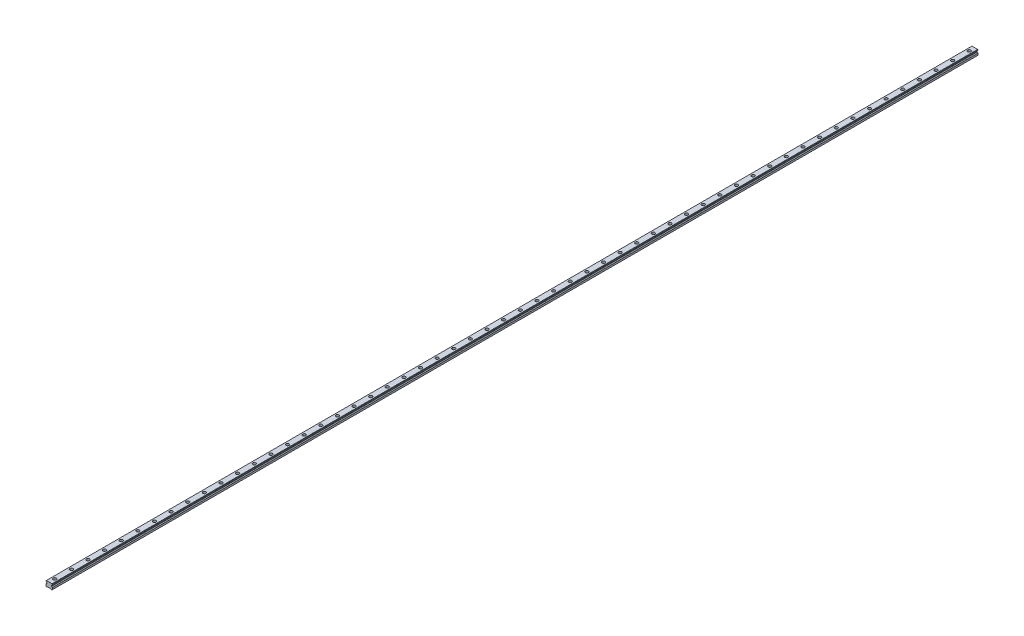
from build123d import *

# Parameters (mm, degrees)
SKETCH1_W           = 23
SKETCH1_H           = 19.2
BOSS_EXTRUDE1_DEPTH = 1670
CUT_EXTRUDE1_DEPTH  = 3341.074982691
CHAMFER1_SIZE       = 1.25
FILLET1_R           = 1.25
CUT_EXTRUDE2_DEPTH  = 3341.074982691
SKETCH4_R           = 5.5
SKETCH4_R_2         = 3.5
CUT_EXTRUDE3_DEPTH  = 9
SKETCH4_2_R         = 3.5
CUT_EXTRUDE4_DEPTH  = 1671.149960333
LPATTERN1_COUNT     = 56
LPATTERN1_PITCH     = 60


with BuildPart() as part:
    # Sketch1 → Boss-Extrude1 (new, symmetric)
    with BuildSketch(Plane.XY):
        with Locations((0, 9.6)):
            Rectangle(SKETCH1_W, SKETCH1_H)
    extrude(amount=BOSS_EXTRUDE1_DEPTH, both=True)

    # Sketch2 → Cut-Extrude1 (cut, through all)
    with BuildSketch(Plane.XY.offset(1670)):
        Polygon((-11.5, 16.7), (-11.5, 7.95), (-8.583333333, 10.866666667), (-8.583333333, 13.783333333), align=None)
        Polygon((8.583333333, 13.783333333), (11.5, 16.7), (11.5, 7.95), (8.583333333, 10.866666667), align=None)
    extrude(amount=-CUT_EXTRUDE1_DEPTH, mode=Mode.SUBTRACT)

    # Chamfer1
    chamfer1_edges = [part.edges().sort_by_distance(p)[0] for p in [
        (-11.5, 19.2, 0),
        (11.5, 19.2, 0),
        (11.5, 0, 0),
        (-11.5, 0, 0),
    ]]
    chamfer(chamfer1_edges, length=CHAMFER1_SIZE)

    # Fillet1
    fillet1_edges = [part.edges().sort_by_distance(p)[0] for p in [
        (-8.583333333, 13.783333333, 0),
        (-8.583333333, 10.866666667, 0),
        (8.583333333, 10.866666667, 0),
        (8.583333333, 13.783333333, 0),
    ]]
    fillet(fillet1_edges, radius=FILLET1_R)

    # Sketch3 → Cut-Extrude2 (cut, through all)
    with BuildSketch(Plane.XY.offset(1670)):
        Polygon((-7, 0), (-5.75, 1.25), (5.75, 1.25), (7, 0), align=None)
    extrude(amount=-CUT_EXTRUDE2_DEPTH, mode=Mode.SUBTRACT)

    # Sketch4 → Cut-Extrude3 (cut)
    with BuildSketch(Plane(origin=(0, 19.2, 0), x_dir=(1, 0, 0), z_dir=(0, 1, 0))):
        with Locations(Location((0, -1650, 0), (0, 0, 270))):
            Circle(SKETCH4_R)
        with Locations(Location((0, -1650, 0), (0, 0, 270))):
            Circle(SKETCH4_R_2, mode=Mode.SUBTRACT)
    cut_extrude3 = extrude(amount=-CUT_EXTRUDE3_DEPTH, mode=Mode.SUBTRACT)

    # Sketch4_2 → Cut-Extrude4 (cut, through all)
    with BuildSketch(Plane(origin=(0, 19.2, 0), x_dir=(1, 0, 0), z_dir=(0, 1, 0))):
        with Locations(Location((0, -1650, 0), (0, 0, 270))):
            Circle(SKETCH4_2_R)
    cut_extrude4 = extrude(amount=-CUT_EXTRUDE4_DEPTH, mode=Mode.SUBTRACT)

    # LPattern1: Cut-Extrude3, Cut-Extrude4 ×56
    with Locations(*[(0, 0, -i * LPATTERN1_PITCH) for i in range(1, LPATTERN1_COUNT)]):
        add(cut_extrude3, mode=Mode.SUBTRACT)
        add(cut_extrude4, mode=Mode.SUBTRACT)


solid = part.part
